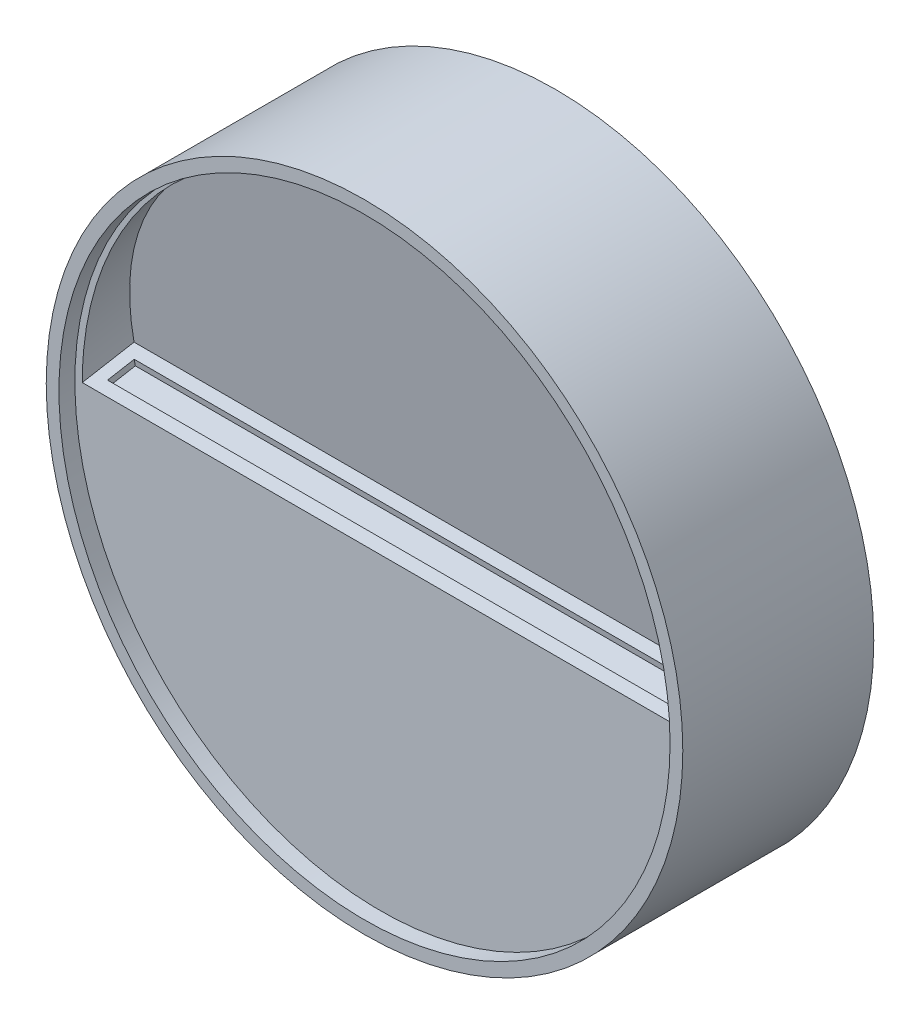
ISO-10303-21;
HEADER;
FILE_DESCRIPTION(('STEP AP214'),'2;1');
FILE_NAME('part.step','',(''),(''),'','','');
FILE_SCHEMA(('AUTOMOTIVE_DESIGN { 1 0 10303 214 1 1 1 1 }'));
ENDSEC;
DATA;
#1=APPLICATION_CONTEXT('core data for automotive mechanical design processes');
#2=APPLICATION_PROTOCOL_DEFINITION('international standard','automotive_design',2000,#1);
#3=PRODUCT_CONTEXT('',#1,'mechanical');
#4=PRODUCT('Part','Part','',(#3));
#5=PRODUCT_RELATED_PRODUCT_CATEGORY('part','',(#4));
#6=PRODUCT_DEFINITION_FORMATION('','',#4);
#7=PRODUCT_DEFINITION_CONTEXT('part definition',#1,'design');
#8=PRODUCT_DEFINITION('design','',#6,#7);
#9=PRODUCT_DEFINITION_SHAPE('','',#8);
#10=(LENGTH_UNIT() NAMED_UNIT(*) SI_UNIT(.MILLI.,.METRE.));
#11=(NAMED_UNIT(*) PLANE_ANGLE_UNIT() SI_UNIT($,.RADIAN.));
#12=(NAMED_UNIT(*) SI_UNIT($,.STERADIAN.) SOLID_ANGLE_UNIT());
#13=UNCERTAINTY_MEASURE_WITH_UNIT(LENGTH_MEASURE(1.E-05),#10,'distance_accuracy_value','');
#14=(GEOMETRIC_REPRESENTATION_CONTEXT(3) GLOBAL_UNCERTAINTY_ASSIGNED_CONTEXT((#13)) GLOBAL_UNIT_ASSIGNED_CONTEXT((#10,
#11,#12)) REPRESENTATION_CONTEXT('',''));
#15=CARTESIAN_POINT('',(0.,0.,0.));
#16=DIRECTION('',(0.,0.,1.));
#17=DIRECTION('',(1.,0.,0.));
#18=AXIS2_PLACEMENT_3D('',#15,#16,#17);
#19=CARTESIAN_POINT('',(0.,0.,27.5));
#20=DIRECTION('',(0.,0.,1.));
#21=DIRECTION('',(1.,0.,0.));
#22=AXIS2_PLACEMENT_3D('',#19,#20,#21);
#23=PLANE('',#22);
#24=CARTESIAN_POINT('',(0.,0.,27.5));
#25=DIRECTION('',(0.,0.,1.));
#26=DIRECTION('',(1.,0.,0.));
#27=AXIS2_PLACEMENT_3D('',#24,#25,#26);
#28=CIRCLE('',#27,48.);
#29=CARTESIAN_POINT('',(0.,48.,27.5));
#30=VERTEX_POINT('',#29);
#31=EDGE_CURVE('E161',#30,#30,#28,.T.);
#32=ORIENTED_EDGE('',*,*,#31,.T.);
#33=CARTESIAN_POINT('',(0.,0.440817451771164,27.5));
#34=DIRECTION('',(0.,0.,1.));
#35=DIRECTION('',(0.,1.,0.));
#36=AXIS2_PLACEMENT_3D('',#33,#34,#35);
#37=ELLIPSE('',#36,47.5591825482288,46.8366517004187);
#38=CARTESIAN_POINT('',(46.8366517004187,0.440817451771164,27.5));
#39=VERTEX_POINT('',#38);
#40=EDGE_CURVE('E11',#30,#39,#37,.F.);
#41=ORIENTED_EDGE('',*,*,#40,.T.);
#42=DIRECTION('',(-1.,0.,0.));
#43=VECTOR('',#42,1.);
#44=CARTESIAN_POINT('',(0.,0.440817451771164,27.5));
#45=LINE('',#44,#43);
#46=CARTESIAN_POINT('',(-46.8366517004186,0.440817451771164,27.5));
#47=VERTEX_POINT('',#46);
#48=EDGE_CURVE('E173',#39,#47,#45,.T.);
#49=ORIENTED_EDGE('',*,*,#48,.T.);
#50=EDGE_CURVE('E43',#47,#30,#37,.F.);
#51=ORIENTED_EDGE('',*,*,#50,.T.);
#52=EDGE_LOOP('',(#32,#41,#49,#51));
#53=FACE_BOUND('',#52,.T.);
#54=ADVANCED_FACE('F39',(#53),#23,.T.);
#55=CARTESIAN_POINT('',(0.,0.,30.));
#56=DIRECTION('',(0.,0.,-1.));
#57=DIRECTION('',(-1.,0.,0.));
#58=AXIS2_PLACEMENT_3D('',#55,#56,#57);
#59=CYLINDRICAL_SURFACE('',#58,50.);
#60=CARTESIAN_POINT('',(0.,0.,30.));
#61=DIRECTION('',(0.,0.,1.));
#62=DIRECTION('',(1.,0.,0.));
#63=AXIS2_PLACEMENT_3D('',#60,#61,#62);
#64=CIRCLE('',#63,50.);
#65=CARTESIAN_POINT('',(50.,0.,30.));
#66=VERTEX_POINT('',#65);
#67=EDGE_CURVE('E169',#66,#66,#64,.T.);
#68=ORIENTED_EDGE('',*,*,#67,.F.);
#69=EDGE_LOOP('',(#68));
#70=FACE_BOUND('',#69,.T.);
#71=CARTESIAN_POINT('',(0.,0.,0.));
#72=DIRECTION('',(0.,0.,1.));
#73=DIRECTION('',(1.,0.,0.));
#74=AXIS2_PLACEMENT_3D('',#71,#72,#73);
#75=CIRCLE('',#74,50.);
#76=CARTESIAN_POINT('',(50.,0.,0.));
#77=VERTEX_POINT('',#76);
#78=EDGE_CURVE('E165',#77,#77,#75,.T.);
#79=ORIENTED_EDGE('',*,*,#78,.T.);
#80=EDGE_LOOP('',(#79));
#81=FACE_BOUND('',#80,.T.);
#82=ADVANCED_FACE('F41',(#70,#81),#59,.T.);
#83=CARTESIAN_POINT('',(0.,0.,30.));
#84=DIRECTION('',(0.,0.,1.));
#85=DIRECTION('',(1.,0.,0.));
#86=AXIS2_PLACEMENT_3D('',#83,#84,#85);
#87=PLANE('',#86);
#88=CARTESIAN_POINT('',(0.,0.,30.));
#89=DIRECTION('',(0.,0.,1.));
#90=DIRECTION('',(1.,0.,0.));
#91=AXIS2_PLACEMENT_3D('',#88,#89,#90);
#92=CIRCLE('',#91,48.);
#93=CARTESIAN_POINT('',(48.,0.,30.));
#94=VERTEX_POINT('',#93);
#95=EDGE_CURVE('E160',#94,#94,#92,.T.);
#96=ORIENTED_EDGE('',*,*,#95,.F.);
#97=EDGE_LOOP('',(#96));
#98=FACE_BOUND('',#97,.T.);
#99=ORIENTED_EDGE('',*,*,#67,.T.);
#100=EDGE_LOOP('',(#99));
#101=FACE_BOUND('',#100,.T.);
#102=ADVANCED_FACE('F208',(#98,#101),#87,.T.);
#103=CARTESIAN_POINT('',(0.,0.,0.));
#104=DIRECTION('',(0.,0.,1.));
#105=DIRECTION('',(1.,0.,0.));
#106=AXIS2_PLACEMENT_3D('',#103,#104,#105);
#107=PLANE('',#106);
#108=ORIENTED_EDGE('',*,*,#78,.F.);
#109=EDGE_LOOP('',(#108));
#110=FACE_BOUND('',#109,.T.);
#111=ADVANCED_FACE('F214',(#110),#107,.F.);
#112=CARTESIAN_POINT('',(0.,0.,27.5));
#113=DIRECTION('',(0.,0.,1.));
#114=DIRECTION('',(1.,0.,0.));
#115=AXIS2_PLACEMENT_3D('',#112,#113,#114);
#116=CYLINDRICAL_SURFACE('',#115,48.);
#117=ORIENTED_EDGE('',*,*,#31,.F.);
#118=EDGE_LOOP('',(#117));
#119=FACE_BOUND('',#118,.T.);
#120=ORIENTED_EDGE('',*,*,#95,.T.);
#121=EDGE_LOOP('',(#120));
#122=FACE_BOUND('',#121,.T.);
#123=ADVANCED_FACE('F211',(#119,#122),#116,.F.);
#124=CARTESIAN_POINT('',(0.,-1.5076844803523,38.5505035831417));
#125=DIRECTION('',(0.,0.173648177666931,-0.984807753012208));
#126=DIRECTION('',(0.,0.984807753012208,0.173648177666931));
#127=AXIS2_PLACEMENT_3D('',#124,#125,#126);
#128=CYLINDRICAL_SURFACE('',#127,46.8366517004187);
#129=CARTESIAN_POINT('',(0.,1.87490228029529,19.3669007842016));
#130=DIRECTION('',(0.,-0.173648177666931,0.984807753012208));
#131=DIRECTION('',(0.,-0.984807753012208,-0.173648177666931));
#132=AXIS2_PLACEMENT_3D('',#129,#130,#131);
#133=CIRCLE('',#132,46.8366517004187);
#134=CARTESIAN_POINT('',(46.8366517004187,1.87490228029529,19.3669007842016));
#135=VERTEX_POINT('',#134);
#136=EDGE_CURVE('E147',#135,#30,#133,.T.);
#137=ORIENTED_EDGE('',*,*,#136,.F.);
#138=DIRECTION('',(0.,0.173648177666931,-0.984807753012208));
#139=VECTOR('',#138,1.);
#140=CARTESIAN_POINT('',(46.8366517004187,-1.5076844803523,38.5505035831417));
#141=LINE('',#140,#139);
#142=EDGE_CURVE('E155',#39,#135,#141,.T.);
#143=ORIENTED_EDGE('',*,*,#142,.F.);
#144=ORIENTED_EDGE('',*,*,#40,.F.);
#145=EDGE_LOOP('',(#137,#143,#144));
#146=FACE_BOUND('',#145,.T.);
#147=ADVANCED_FACE('F192',(#146),#128,.F.);
#148=DIRECTION('',(0.,0.173648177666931,-0.984807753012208));
#149=VECTOR('',#148,1.);
#150=CARTESIAN_POINT('',(-46.8366517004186,-1.5076844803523,38.5505035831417));
#151=LINE('',#150,#149);
#152=CARTESIAN_POINT('',(-46.8366517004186,1.87490228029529,19.3669007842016));
#153=VERTEX_POINT('',#152);
#154=EDGE_CURVE('E63',#47,#153,#151,.T.);
#155=ORIENTED_EDGE('',*,*,#154,.T.);
#156=EDGE_CURVE('E141',#30,#153,#133,.T.);
#157=ORIENTED_EDGE('',*,*,#156,.F.);
#158=ORIENTED_EDGE('',*,*,#50,.F.);
#159=EDGE_LOOP('',(#155,#157,#158));
#160=FACE_BOUND('',#159,.T.);
#161=ADVANCED_FACE('F184',(#160),#128,.F.);
#162=CARTESIAN_POINT('',(-46.8366517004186,-1.5076844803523,38.5505035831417));
#163=DIRECTION('',(0.,0.984807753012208,0.173648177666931));
#164=DIRECTION('',(0.,-0.173648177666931,0.984807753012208));
#165=AXIS2_PLACEMENT_3D('',#162,#163,#164);
#166=PLANE('',#165);
#167=DIRECTION('',(1.,0.,0.));
#168=VECTOR('',#167,1.);
#169=CARTESIAN_POINT('',(-44.8366517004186,0.788113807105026,25.5303844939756));
#170=LINE('',#169,#168);
#171=CARTESIAN_POINT('',(-44.8366517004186,0.788113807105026,25.5303844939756));
#172=VERTEX_POINT('',#171);
#173=CARTESIAN_POINT('',(44.8366517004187,0.788113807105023,25.5303844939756));
#174=VERTEX_POINT('',#173);
#175=EDGE_CURVE('E55',#172,#174,#170,.T.);
#176=ORIENTED_EDGE('',*,*,#175,.F.);
#177=DIRECTION('',(0.,-0.173648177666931,0.984807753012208));
#178=VECTOR('',#177,1.);
#179=CARTESIAN_POINT('',(-44.8366517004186,1.52760592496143,21.336516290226));
#180=LINE('',#179,#178);
#181=CARTESIAN_POINT('',(-44.8366517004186,1.52760592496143,21.336516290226));
#182=VERTEX_POINT('',#181);
#183=EDGE_CURVE('E119',#182,#172,#180,.T.);
#184=ORIENTED_EDGE('',*,*,#183,.F.);
#185=DIRECTION('',(-1.,0.,0.));
#186=VECTOR('',#185,1.);
#187=CARTESIAN_POINT('',(44.8366517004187,1.52760592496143,21.336516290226));
#188=LINE('',#187,#186);
#189=CARTESIAN_POINT('',(44.8366517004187,1.52760592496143,21.336516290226));
#190=VERTEX_POINT('',#189);
#191=EDGE_CURVE('E123',#190,#182,#188,.T.);
#192=ORIENTED_EDGE('',*,*,#191,.F.);
#193=DIRECTION('',(0.,0.173648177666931,-0.984807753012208));
#194=VECTOR('',#193,1.);
#195=CARTESIAN_POINT('',(44.8366517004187,0.788113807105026,25.5303844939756));
#196=LINE('',#195,#194);
#197=EDGE_CURVE('E132',#174,#190,#196,.T.);
#198=ORIENTED_EDGE('',*,*,#197,.F.);
#199=EDGE_LOOP('',(#176,#184,#192,#198));
#200=FACE_BOUND('',#199,.T.);
#201=ORIENTED_EDGE('',*,*,#142,.T.);
#202=DIRECTION('',(1.,0.,0.));
#203=VECTOR('',#202,1.);
#204=CARTESIAN_POINT('',(-46.8366517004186,1.87490228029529,19.3669007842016));
#205=LINE('',#204,#203);
#206=EDGE_CURVE('E151',#153,#135,#205,.T.);
#207=ORIENTED_EDGE('',*,*,#206,.F.);
#208=ORIENTED_EDGE('',*,*,#154,.F.);
#209=ORIENTED_EDGE('',*,*,#48,.F.);
#210=EDGE_LOOP('',(#201,#207,#208,#209));
#211=FACE_BOUND('',#210,.T.);
#212=ADVANCED_FACE('F193',(#200,#211),#166,.T.);
#213=CARTESIAN_POINT('',(0.,1.87490228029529,19.3669007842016));
#214=DIRECTION('',(0.,-0.173648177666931,0.984807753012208));
#215=DIRECTION('',(0.,-0.984807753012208,-0.173648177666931));
#216=AXIS2_PLACEMENT_3D('',#213,#214,#215);
#217=PLANE('',#216);
#218=ORIENTED_EDGE('',*,*,#136,.T.);
#219=ORIENTED_EDGE('',*,*,#156,.T.);
#220=ORIENTED_EDGE('',*,*,#206,.T.);
#221=EDGE_LOOP('',(#218,#219,#220));
#222=FACE_BOUND('',#221,.T.);
#223=ADVANCED_FACE('F189',(#222),#217,.T.);
#224=CARTESIAN_POINT('',(-44.8366517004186,-0.196693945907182,25.3567363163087));
#225=DIRECTION('',(0.,-0.173648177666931,0.984807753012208));
#226=DIRECTION('',(0.,-0.984807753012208,-0.173648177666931));
#227=AXIS2_PLACEMENT_3D('',#224,#225,#226);
#228=PLANE('',#227);
#229=ORIENTED_EDGE('',*,*,#175,.T.);
#230=DIRECTION('',(0.,0.984807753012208,0.173648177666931));
#231=VECTOR('',#230,1.);
#232=CARTESIAN_POINT('',(44.8366517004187,-0.196693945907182,25.3567363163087));
#233=LINE('',#232,#231);
#234=CARTESIAN_POINT('',(44.8366517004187,-0.196693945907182,25.3567363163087));
#235=VERTEX_POINT('',#234);
#236=EDGE_CURVE('E94',#235,#174,#233,.T.);
#237=ORIENTED_EDGE('',*,*,#236,.F.);
#238=DIRECTION('',(1.,0.,0.));
#239=VECTOR('',#238,1.);
#240=CARTESIAN_POINT('',(-44.8366517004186,-0.196693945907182,25.3567363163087));
#241=LINE('',#240,#239);
#242=CARTESIAN_POINT('',(-44.8366517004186,-0.196693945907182,25.3567363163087));
#243=VERTEX_POINT('',#242);
#244=EDGE_CURVE('E98',#243,#235,#241,.T.);
#245=ORIENTED_EDGE('',*,*,#244,.F.);
#246=DIRECTION('',(0.,0.984807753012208,0.173648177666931));
#247=VECTOR('',#246,1.);
#248=CARTESIAN_POINT('',(-44.8366517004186,-0.196693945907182,25.3567363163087));
#249=LINE('',#248,#247);
#250=EDGE_CURVE('E138',#243,#172,#249,.T.);
#251=ORIENTED_EDGE('',*,*,#250,.T.);
#252=EDGE_LOOP('',(#229,#237,#245,#251));
#253=FACE_BOUND('',#252,.T.);
#254=ADVANCED_FACE('F96',(#253),#228,.F.);
#255=CARTESIAN_POINT('',(-44.8366517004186,0.542798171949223,21.162868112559));
#256=DIRECTION('',(-1.,0.,0.));
#257=DIRECTION('',(0.,0.,1.));
#258=AXIS2_PLACEMENT_3D('',#255,#256,#257);
#259=PLANE('',#258);
#260=ORIENTED_EDGE('',*,*,#183,.T.);
#261=ORIENTED_EDGE('',*,*,#250,.F.);
#262=DIRECTION('',(0.,-0.173648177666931,0.984807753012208));
#263=VECTOR('',#262,1.);
#264=CARTESIAN_POINT('',(-44.8366517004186,0.542798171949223,21.162868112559));
#265=LINE('',#264,#263);
#266=CARTESIAN_POINT('',(-44.8366517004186,0.542798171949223,21.162868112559));
#267=VERTEX_POINT('',#266);
#268=EDGE_CURVE('E105',#267,#243,#265,.T.);
#269=ORIENTED_EDGE('',*,*,#268,.F.);
#270=DIRECTION('',(0.,0.984807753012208,0.173648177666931));
#271=VECTOR('',#270,1.);
#272=CARTESIAN_POINT('',(-44.8366517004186,0.542798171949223,21.162868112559));
#273=LINE('',#272,#271);
#274=EDGE_CURVE('E142',#267,#182,#273,.T.);
#275=ORIENTED_EDGE('',*,*,#274,.T.);
#276=EDGE_LOOP('',(#260,#261,#269,#275));
#277=FACE_BOUND('',#276,.T.);
#278=ADVANCED_FACE('F259',(#277),#259,.F.);
#279=CARTESIAN_POINT('',(44.8366517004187,0.542798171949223,21.162868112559));
#280=DIRECTION('',(0.,0.173648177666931,-0.984807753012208));
#281=DIRECTION('',(0.,0.984807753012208,0.173648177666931));
#282=AXIS2_PLACEMENT_3D('',#279,#280,#281);
#283=PLANE('',#282);
#284=ORIENTED_EDGE('',*,*,#191,.T.);
#285=ORIENTED_EDGE('',*,*,#274,.F.);
#286=DIRECTION('',(-1.,0.,0.));
#287=VECTOR('',#286,1.);
#288=CARTESIAN_POINT('',(44.8366517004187,0.542798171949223,21.162868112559));
#289=LINE('',#288,#287);
#290=CARTESIAN_POINT('',(44.8366517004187,0.542798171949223,21.162868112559));
#291=VERTEX_POINT('',#290);
#292=EDGE_CURVE('E114',#291,#267,#289,.T.);
#293=ORIENTED_EDGE('',*,*,#292,.F.);
#294=DIRECTION('',(0.,0.984807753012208,0.173648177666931));
#295=VECTOR('',#294,1.);
#296=CARTESIAN_POINT('',(44.8366517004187,0.542798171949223,21.162868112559));
#297=LINE('',#296,#295);
#298=EDGE_CURVE('E104',#291,#190,#297,.T.);
#299=ORIENTED_EDGE('',*,*,#298,.T.);
#300=EDGE_LOOP('',(#284,#285,#293,#299));
#301=FACE_BOUND('',#300,.T.);
#302=ADVANCED_FACE('F268',(#301),#283,.F.);
#303=CARTESIAN_POINT('',(44.8366517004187,-0.196693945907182,25.3567363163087));
#304=DIRECTION('',(1.,0.,0.));
#305=DIRECTION('',(0.,0.,-1.));
#306=AXIS2_PLACEMENT_3D('',#303,#304,#305);
#307=PLANE('',#306);
#308=ORIENTED_EDGE('',*,*,#197,.T.);
#309=ORIENTED_EDGE('',*,*,#298,.F.);
#310=DIRECTION('',(0.,0.173648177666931,-0.984807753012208));
#311=VECTOR('',#310,1.);
#312=CARTESIAN_POINT('',(44.8366517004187,-0.196693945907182,25.3567363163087));
#313=LINE('',#312,#311);
#314=EDGE_CURVE('E108',#235,#291,#313,.T.);
#315=ORIENTED_EDGE('',*,*,#314,.F.);
#316=ORIENTED_EDGE('',*,*,#236,.T.);
#317=EDGE_LOOP('',(#308,#309,#315,#316));
#318=FACE_BOUND('',#317,.T.);
#319=ADVANCED_FACE('F109',(#318),#307,.F.);
#320=CARTESIAN_POINT('',(0.,4.14549439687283,0.730962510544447));
#321=DIRECTION('',(0.,0.984807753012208,0.173648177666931));
#322=DIRECTION('',(0.,-0.173648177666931,0.984807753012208));
#323=AXIS2_PLACEMENT_3D('',#320,#321,#322);
#324=PLANE('',#323);
#325=ORIENTED_EDGE('',*,*,#244,.T.);
#326=ORIENTED_EDGE('',*,*,#314,.T.);
#327=ORIENTED_EDGE('',*,*,#292,.T.);
#328=ORIENTED_EDGE('',*,*,#268,.T.);
#329=EDGE_LOOP('',(#325,#326,#327,#328));
#330=FACE_BOUND('',#329,.T.);
#331=ADVANCED_FACE('F116',(#330),#324,.T.);
#332=CLOSED_SHELL('',(#54,#82,#102,#111,#123,#147,#161,#212,#223,#254,#278,#302,#319,#331));
#333=MANIFOLD_SOLID_BREP('B2',#332);
#334=ADVANCED_BREP_SHAPE_REPRESENTATION('',(#18,#333),#14);
#335=SHAPE_DEFINITION_REPRESENTATION(#9,#334);
ENDSEC;
END-ISO-10303-21;
